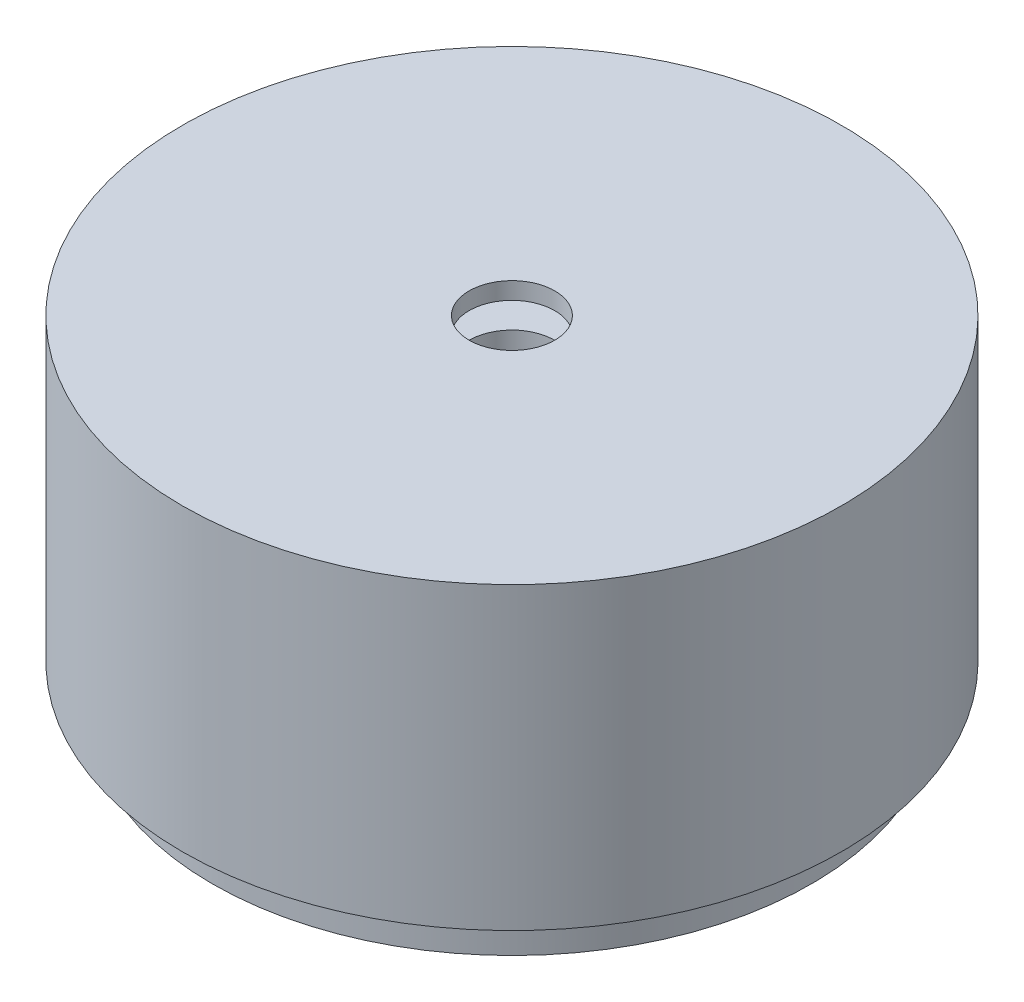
ISO-10303-21;
HEADER;
FILE_DESCRIPTION(('STEP AP214'),'2;1');
FILE_NAME('part.step','',(''),(''),'','','');
FILE_SCHEMA(('AUTOMOTIVE_DESIGN { 1 0 10303 214 1 1 1 1 }'));
ENDSEC;
DATA;
#1=APPLICATION_CONTEXT('core data for automotive mechanical design processes');
#2=APPLICATION_PROTOCOL_DEFINITION('international standard','automotive_design',2000,#1);
#3=PRODUCT_CONTEXT('',#1,'mechanical');
#4=PRODUCT('Part','Part','',(#3));
#5=PRODUCT_RELATED_PRODUCT_CATEGORY('part','',(#4));
#6=PRODUCT_DEFINITION_FORMATION('','',#4);
#7=PRODUCT_DEFINITION_CONTEXT('part definition',#1,'design');
#8=PRODUCT_DEFINITION('design','',#6,#7);
#9=PRODUCT_DEFINITION_SHAPE('','',#8);
#10=(LENGTH_UNIT() NAMED_UNIT(*) SI_UNIT(.MILLI.,.METRE.));
#11=(NAMED_UNIT(*) PLANE_ANGLE_UNIT() SI_UNIT($,.RADIAN.));
#12=(NAMED_UNIT(*) SI_UNIT($,.STERADIAN.) SOLID_ANGLE_UNIT());
#13=UNCERTAINTY_MEASURE_WITH_UNIT(LENGTH_MEASURE(1.E-05),#10,'distance_accuracy_value','');
#14=(GEOMETRIC_REPRESENTATION_CONTEXT(3) GLOBAL_UNCERTAINTY_ASSIGNED_CONTEXT((#13)) GLOBAL_UNIT_ASSIGNED_CONTEXT((#10,
#11,#12)) REPRESENTATION_CONTEXT('',''));
#15=CARTESIAN_POINT('',(0.,0.,0.));
#16=DIRECTION('',(0.,0.,1.));
#17=DIRECTION('',(1.,0.,0.));
#18=AXIS2_PLACEMENT_3D('',#15,#16,#17);
#19=CARTESIAN_POINT('',(0.,38.,0.));
#20=DIRECTION('',(0.,-1.,0.));
#21=DIRECTION('',(0.,0.,-1.));
#22=AXIS2_PLACEMENT_3D('',#19,#20,#21);
#23=CYLINDRICAL_SURFACE('',#22,38.5);
#24=CARTESIAN_POINT('',(0.,5.,0.));
#25=DIRECTION('',(0.,1.,0.));
#26=DIRECTION('',(0.,0.,1.));
#27=AXIS2_PLACEMENT_3D('',#24,#25,#26);
#28=CIRCLE('',#27,38.5);
#29=CARTESIAN_POINT('',(0.,5.,38.5));
#30=VERTEX_POINT('',#29);
#31=EDGE_CURVE('E11',#30,#30,#28,.T.);
#32=ORIENTED_EDGE('',*,*,#31,.T.);
#33=EDGE_LOOP('',(#32));
#34=FACE_BOUND('',#33,.T.);
#35=CARTESIAN_POINT('',(0.,40.,0.));
#36=DIRECTION('',(0.,1.,0.));
#37=DIRECTION('',(0.,0.,1.));
#38=AXIS2_PLACEMENT_3D('',#35,#36,#37);
#39=CIRCLE('',#38,38.5);
#40=CARTESIAN_POINT('',(0.,40.,38.5));
#41=VERTEX_POINT('',#40);
#42=EDGE_CURVE('E61',#41,#41,#39,.T.);
#43=ORIENTED_EDGE('',*,*,#42,.F.);
#44=EDGE_LOOP('',(#43));
#45=FACE_BOUND('',#44,.T.);
#46=ADVANCED_FACE('F45',(#34,#45),#23,.T.);
#47=CARTESIAN_POINT('',(0.,38.,0.));
#48=DIRECTION('',(0.,-1.,0.));
#49=DIRECTION('',(0.,0.,-1.));
#50=AXIS2_PLACEMENT_3D('',#47,#48,#49);
#51=CYLINDRICAL_SURFACE('',#50,36.5);
#52=CARTESIAN_POINT('',(0.,38.,0.));
#53=DIRECTION('',(0.,1.,0.));
#54=DIRECTION('',(0.,0.,1.));
#55=AXIS2_PLACEMENT_3D('',#52,#53,#54);
#56=CIRCLE('',#55,36.5);
#57=CARTESIAN_POINT('',(0.,38.,36.5));
#58=VERTEX_POINT('',#57);
#59=EDGE_CURVE('E57',#58,#58,#56,.T.);
#60=ORIENTED_EDGE('',*,*,#59,.T.);
#61=EDGE_LOOP('',(#60));
#62=FACE_BOUND('',#61,.T.);
#63=CARTESIAN_POINT('',(0.,5.,0.));
#64=DIRECTION('',(0.,1.,0.));
#65=DIRECTION('',(0.,0.,1.));
#66=AXIS2_PLACEMENT_3D('',#63,#64,#65);
#67=CIRCLE('',#66,36.5);
#68=CARTESIAN_POINT('',(0.,5.,36.5));
#69=VERTEX_POINT('',#68);
#70=EDGE_CURVE('E52',#69,#69,#67,.T.);
#71=ORIENTED_EDGE('',*,*,#70,.F.);
#72=EDGE_LOOP('',(#71));
#73=FACE_BOUND('',#72,.T.);
#74=ADVANCED_FACE('F84',(#62,#73),#51,.F.);
#75=CARTESIAN_POINT('',(0.,5.,0.));
#76=DIRECTION('',(0.,1.,0.));
#77=DIRECTION('',(0.,0.,1.));
#78=AXIS2_PLACEMENT_3D('',#75,#76,#77);
#79=PLANE('',#78);
#80=ORIENTED_EDGE('',*,*,#70,.T.);
#81=EDGE_LOOP('',(#80));
#82=FACE_BOUND('',#81,.T.);
#83=ORIENTED_EDGE('',*,*,#31,.F.);
#84=EDGE_LOOP('',(#83));
#85=FACE_BOUND('',#84,.T.);
#86=ADVANCED_FACE('F88',(#82,#85),#79,.F.);
#87=CARTESIAN_POINT('',(0.,38.,0.));
#88=DIRECTION('',(0.,1.,0.));
#89=DIRECTION('',(0.,0.,1.));
#90=AXIS2_PLACEMENT_3D('',#87,#88,#89);
#91=PLANE('',#90);
#92=CARTESIAN_POINT('',(0.,38.,0.));
#93=DIRECTION('',(0.,1.,0.));
#94=DIRECTION('',(0.,0.,1.));
#95=AXIS2_PLACEMENT_3D('',#92,#93,#94);
#96=CIRCLE('',#95,5.);
#97=CARTESIAN_POINT('',(0.,38.,5.));
#98=VERTEX_POINT('',#97);
#99=EDGE_CURVE('E66',#98,#98,#96,.T.);
#100=ORIENTED_EDGE('',*,*,#99,.T.);
#101=EDGE_LOOP('',(#100));
#102=FACE_BOUND('',#101,.T.);
#103=ORIENTED_EDGE('',*,*,#59,.F.);
#104=EDGE_LOOP('',(#103));
#105=FACE_BOUND('',#104,.T.);
#106=ADVANCED_FACE('F79',(#102,#105),#91,.F.);
#107=CARTESIAN_POINT('',(0.,40.,0.));
#108=DIRECTION('',(0.,1.,0.));
#109=DIRECTION('',(0.,0.,1.));
#110=AXIS2_PLACEMENT_3D('',#107,#108,#109);
#111=PLANE('',#110);
#112=CARTESIAN_POINT('',(0.,40.,0.));
#113=DIRECTION('',(0.,1.,0.));
#114=DIRECTION('',(0.,0.,1.));
#115=AXIS2_PLACEMENT_3D('',#112,#113,#114);
#116=CIRCLE('',#115,5.);
#117=CARTESIAN_POINT('',(0.,40.,5.));
#118=VERTEX_POINT('',#117);
#119=EDGE_CURVE('E69',#118,#118,#116,.T.);
#120=ORIENTED_EDGE('',*,*,#119,.F.);
#121=EDGE_LOOP('',(#120));
#122=FACE_BOUND('',#121,.T.);
#123=ORIENTED_EDGE('',*,*,#42,.T.);
#124=EDGE_LOOP('',(#123));
#125=FACE_BOUND('',#124,.T.);
#126=ADVANCED_FACE('F76',(#122,#125),#111,.T.);
#127=CARTESIAN_POINT('',(0.,0.,0.));
#128=DIRECTION('',(0.,1.,0.));
#129=DIRECTION('',(0.,0.,1.));
#130=AXIS2_PLACEMENT_3D('',#127,#128,#129);
#131=CYLINDRICAL_SURFACE('',#130,5.);
#132=ORIENTED_EDGE('',*,*,#119,.T.);
#133=EDGE_LOOP('',(#132));
#134=FACE_BOUND('',#133,.T.);
#135=ORIENTED_EDGE('',*,*,#99,.F.);
#136=EDGE_LOOP('',(#135));
#137=FACE_BOUND('',#136,.T.);
#138=ADVANCED_FACE('F73',(#134,#137),#131,.F.);
#139=CLOSED_SHELL('',(#46,#74,#86,#106,#126,#138));
#140=MANIFOLD_SOLID_BREP('B2',#139);
#141=CARTESIAN_POINT('',(0.,35.,0.));
#142=DIRECTION('',(0.,-1.,0.));
#143=DIRECTION('',(0.,0.,-1.));
#144=AXIS2_PLACEMENT_3D('',#141,#142,#143);
#145=CYLINDRICAL_SURFACE('',#144,35.);
#146=CARTESIAN_POINT('',(0.,35.,0.));
#147=DIRECTION('',(0.,1.,0.));
#148=DIRECTION('',(0.,0.,1.));
#149=AXIS2_PLACEMENT_3D('',#146,#147,#148);
#150=CIRCLE('',#149,35.);
#151=CARTESIAN_POINT('',(0.,35.,35.));
#152=VERTEX_POINT('',#151);
#153=EDGE_CURVE('E44',#152,#152,#150,.T.);
#154=ORIENTED_EDGE('',*,*,#153,.F.);
#155=EDGE_LOOP('',(#154));
#156=FACE_BOUND('',#155,.T.);
#157=CARTESIAN_POINT('',(0.,0.,0.));
#158=DIRECTION('',(0.,1.,0.));
#159=DIRECTION('',(0.,0.,1.));
#160=AXIS2_PLACEMENT_3D('',#157,#158,#159);
#161=CIRCLE('',#160,35.);
#162=CARTESIAN_POINT('',(0.,0.,35.));
#163=VERTEX_POINT('',#162);
#164=EDGE_CURVE('E153',#163,#163,#161,.T.);
#165=ORIENTED_EDGE('',*,*,#164,.T.);
#166=EDGE_LOOP('',(#165));
#167=FACE_BOUND('',#166,.T.);
#168=ADVANCED_FACE('F150',(#156,#167),#145,.T.);
#169=CARTESIAN_POINT('',(0.,35.,0.));
#170=DIRECTION('',(0.,1.,0.));
#171=DIRECTION('',(0.,0.,1.));
#172=AXIS2_PLACEMENT_3D('',#169,#170,#171);
#173=PLANE('',#172);
#174=CARTESIAN_POINT('',(0.,35.,0.));
#175=DIRECTION('',(0.,1.,0.));
#176=DIRECTION('',(0.,0.,1.));
#177=AXIS2_PLACEMENT_3D('',#174,#175,#176);
#178=CIRCLE('',#177,5.);
#179=CARTESIAN_POINT('',(0.,35.,5.));
#180=VERTEX_POINT('',#179);
#181=EDGE_CURVE('E161',#180,#180,#178,.T.);
#182=ORIENTED_EDGE('',*,*,#181,.F.);
#183=EDGE_LOOP('',(#182));
#184=FACE_BOUND('',#183,.T.);
#185=ORIENTED_EDGE('',*,*,#153,.T.);
#186=EDGE_LOOP('',(#185));
#187=FACE_BOUND('',#186,.T.);
#188=ADVANCED_FACE('F179',(#184,#187),#173,.T.);
#189=CARTESIAN_POINT('',(0.,0.,0.));
#190=DIRECTION('',(0.,1.,0.));
#191=DIRECTION('',(0.,0.,1.));
#192=AXIS2_PLACEMENT_3D('',#189,#190,#191);
#193=PLANE('',#192);
#194=CARTESIAN_POINT('',(0.,0.,0.));
#195=DIRECTION('',(0.,1.,0.));
#196=DIRECTION('',(0.,0.,1.));
#197=AXIS2_PLACEMENT_3D('',#194,#195,#196);
#198=CIRCLE('',#197,5.);
#199=CARTESIAN_POINT('',(0.,0.,5.));
#200=VERTEX_POINT('',#199);
#201=EDGE_CURVE('E165',#200,#200,#198,.T.);
#202=ORIENTED_EDGE('',*,*,#201,.T.);
#203=EDGE_LOOP('',(#202));
#204=FACE_BOUND('',#203,.T.);
#205=ORIENTED_EDGE('',*,*,#164,.F.);
#206=EDGE_LOOP('',(#205));
#207=FACE_BOUND('',#206,.T.);
#208=ADVANCED_FACE('F169',(#204,#207),#193,.F.);
#209=CARTESIAN_POINT('',(0.,0.,0.));
#210=DIRECTION('',(0.,1.,0.));
#211=DIRECTION('',(0.,0.,1.));
#212=AXIS2_PLACEMENT_3D('',#209,#210,#211);
#213=CYLINDRICAL_SURFACE('',#212,5.);
#214=ORIENTED_EDGE('',*,*,#181,.T.);
#215=EDGE_LOOP('',(#214));
#216=FACE_BOUND('',#215,.T.);
#217=ORIENTED_EDGE('',*,*,#201,.F.);
#218=EDGE_LOOP('',(#217));
#219=FACE_BOUND('',#218,.T.);
#220=ADVANCED_FACE('F172',(#216,#219),#213,.F.);
#221=CLOSED_SHELL('',(#168,#188,#208,#220));
#222=MANIFOLD_SOLID_BREP('B6',#221);
#223=ADVANCED_BREP_SHAPE_REPRESENTATION('',(#18,#140,#222),#14);
#224=SHAPE_DEFINITION_REPRESENTATION(#9,#223);
ENDSEC;
END-ISO-10303-21;
